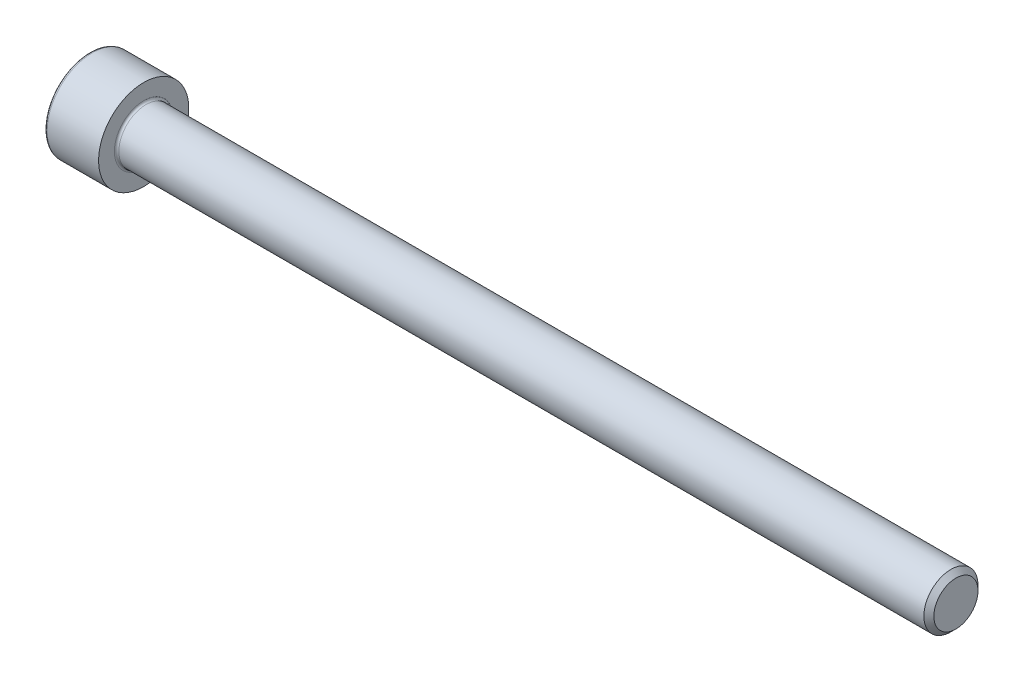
from build123d import *

# Parameters (mm, degrees)
FILLET1_R   = 0.25
FILLET2_R   = 0.3
HEX_2_DEPTH = 3


with BuildPart() as part:
    # BodySke → Base-Revolve (revolve)
    with BuildSketch(Plane.XY, mode=Mode.PRIVATE) as base_revolve_sk:
        Polygon((0, 0), (0, 5), (6, 5), (6, 3), (95.4455, 3), (96, 2.4455), (96, 0), align=None)
    revolve(base_revolve_sk.sketch.rotate(Axis((-31.75, 0, 0), (1, 0, 0)), 90), axis=Axis((-31.75, 0, 0), (1, 0, 0)))

    # Fillet1
    fillet1_edges = [part.edges().sort_by_distance(p)[0] for p in [
        (6, 0, -3),
    ]]
    fillet(fillet1_edges, radius=FILLET1_R)

    # Fillet2
    fillet2_edges = [part.edges().sort_by_distance(p)[0] for p in [
        (0, 0, -5),
    ]]
    fillet(fillet2_edges, radius=FILLET2_R)

    # Sketch2 → Hex-PreBroach (revolve, cut)
    with BuildSketch(Plane.XY, mode=Mode.PRIVATE) as hex_prebroach_sk:
        Polygon((0, 2.542), (3, 2.542), (4.467624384, 0), (0, 0), align=None)
    revolve(hex_prebroach_sk.sketch.rotate(Axis((0, 0, 0), (1, 0, 0)), 90), axis=Axis((0, 0, 0), (1, 0, 0)), mode=Mode.SUBTRACT)

    # Sketch3 → Hex 2 (cut)
    with BuildSketch(Plane(origin=(0, 0, 0), x_dir=(0, 0.500000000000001, 0.866025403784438), z_dir=(-1, 0, 0))):
        Polygon((1.467624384, 2.542), (-1.467624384, 2.542), (-2.935248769, 0), (-1.467624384, -2.542), (1.467624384, -2.542), (2.935248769, 0), align=None)
    extrude(amount=-HEX_2_DEPTH, mode=Mode.SUBTRACT)


solid = part.part
